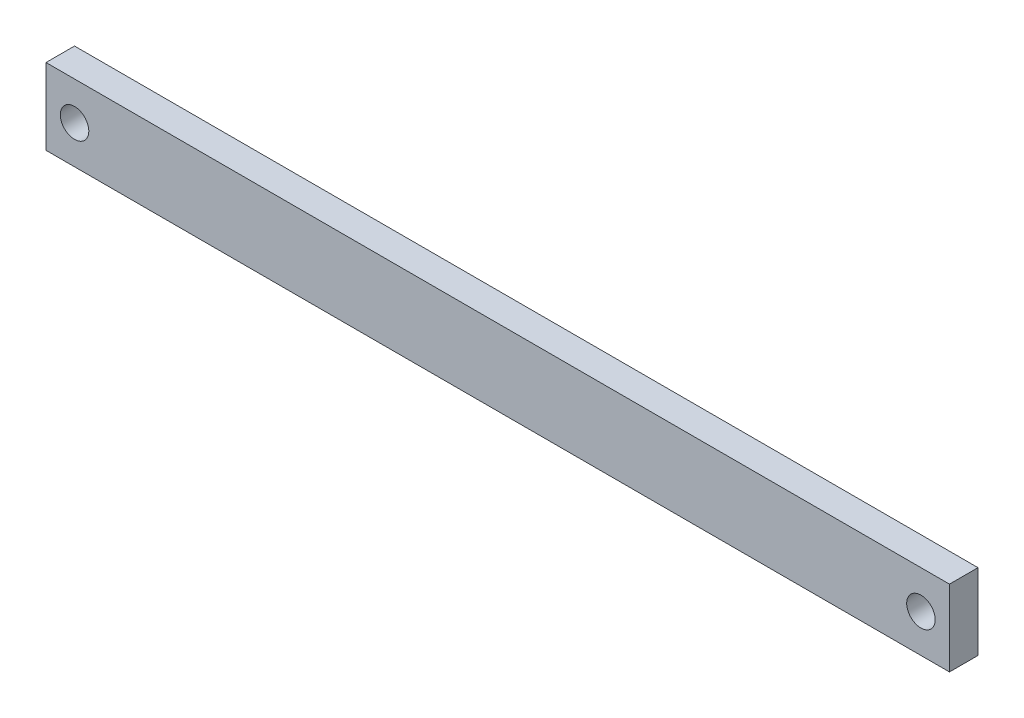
from build123d import *

# Parameters (mm, degrees)
ESQUISSE1_W      = 95
ESQUISSE1_H      = 8
ESQUISSE1_R      = 1.5
EXTRUSION1_DEPTH = 3


with BuildPart() as part:
    # Esquisse1 → Extrusion1 (new body)
    with BuildSketch(Plane.XY):
        with Locations((47.5, 4)):
            Rectangle(ESQUISSE1_W, ESQUISSE1_H)
        with Locations((3, 4)):
            Circle(ESQUISSE1_R, mode=Mode.SUBTRACT)
        with Locations((92, 4)):
            Circle(ESQUISSE1_R, mode=Mode.SUBTRACT)
    extrude(amount=EXTRUSION1_DEPTH)


solid = part.part
